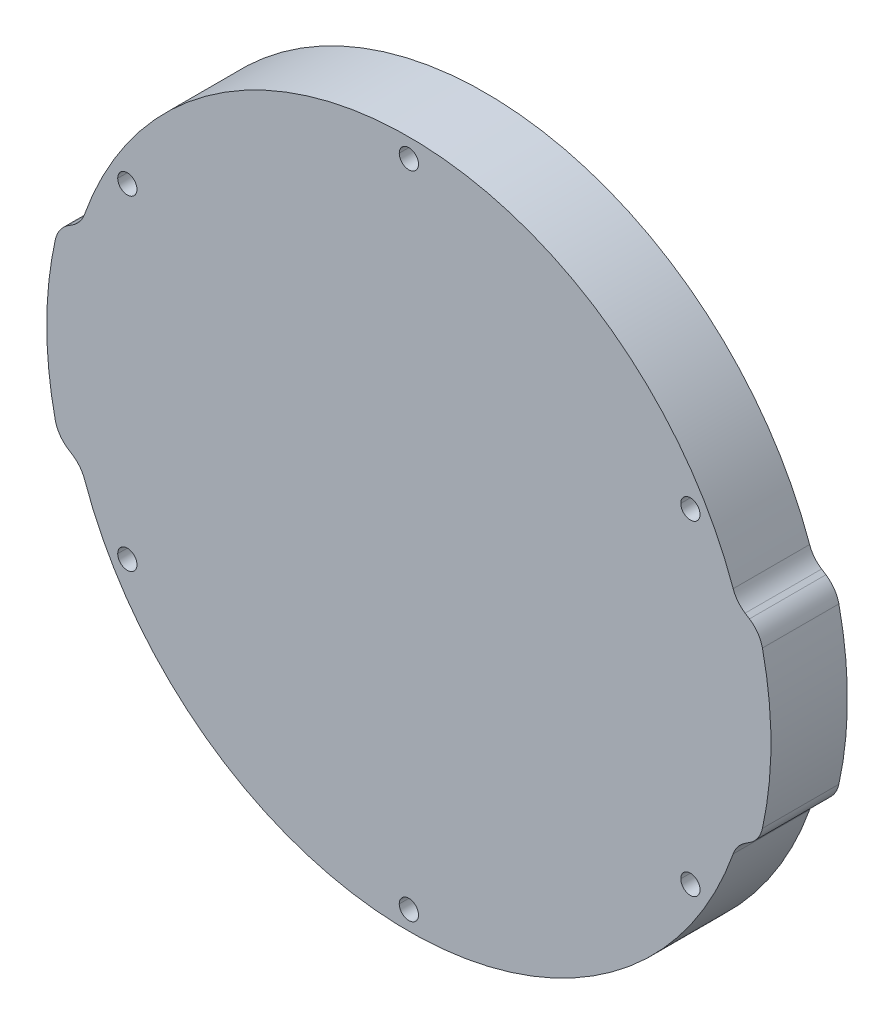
ISO-10303-21;
HEADER;
FILE_DESCRIPTION(('STEP AP214'),'2;1');
FILE_NAME('part.step','',(''),(''),'','','');
FILE_SCHEMA(('AUTOMOTIVE_DESIGN { 1 0 10303 214 1 1 1 1 }'));
ENDSEC;
DATA;
#1=APPLICATION_CONTEXT('core data for automotive mechanical design processes');
#2=APPLICATION_PROTOCOL_DEFINITION('international standard','automotive_design',2000,#1);
#3=PRODUCT_CONTEXT('',#1,'mechanical');
#4=PRODUCT('Part','Part','',(#3));
#5=PRODUCT_RELATED_PRODUCT_CATEGORY('part','',(#4));
#6=PRODUCT_DEFINITION_FORMATION('','',#4);
#7=PRODUCT_DEFINITION_CONTEXT('part definition',#1,'design');
#8=PRODUCT_DEFINITION('design','',#6,#7);
#9=PRODUCT_DEFINITION_SHAPE('','',#8);
#10=(LENGTH_UNIT() NAMED_UNIT(*) SI_UNIT(.MILLI.,.METRE.));
#11=(NAMED_UNIT(*) PLANE_ANGLE_UNIT() SI_UNIT($,.RADIAN.));
#12=(NAMED_UNIT(*) SI_UNIT($,.STERADIAN.) SOLID_ANGLE_UNIT());
#13=UNCERTAINTY_MEASURE_WITH_UNIT(LENGTH_MEASURE(1.E-05),#10,'distance_accuracy_value','');
#14=(GEOMETRIC_REPRESENTATION_CONTEXT(3) GLOBAL_UNCERTAINTY_ASSIGNED_CONTEXT((#13)) GLOBAL_UNIT_ASSIGNED_CONTEXT((#10,
#11,#12)) REPRESENTATION_CONTEXT('',''));
#15=CARTESIAN_POINT('',(0.,0.,0.));
#16=DIRECTION('',(0.,0.,1.));
#17=DIRECTION('',(1.,0.,0.));
#18=AXIS2_PLACEMENT_3D('',#15,#16,#17);
#19=CARTESIAN_POINT('',(-58.5852887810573,20.7457571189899,12.7));
#20=DIRECTION('',(0.,0.,-1.));
#21=DIRECTION('',(-1.,0.,0.));
#22=AXIS2_PLACEMENT_3D('',#19,#20,#21);
#23=CYLINDRICAL_SURFACE('',#22,5.);
#24=CARTESIAN_POINT('',(-58.5852887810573,20.7457571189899,12.7));
#25=DIRECTION('',(0.,0.,-1.));
#26=DIRECTION('',(1.,0.,0.));
#27=AXIS2_PLACEMENT_3D('',#24,#25,#26);
#28=CIRCLE('',#27,5.);
#29=CARTESIAN_POINT('',(-53.87207166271,19.0767501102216,12.7));
#30=VERTEX_POINT('',#29);
#31=CARTESIAN_POINT('',(-55.8597455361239,16.5539300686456,12.7));
#32=VERTEX_POINT('',#31);
#33=EDGE_CURVE('E462',#30,#32,#28,.T.);
#34=ORIENTED_EDGE('',*,*,#33,.F.);
#35=DIRECTION('',(0.,0.,1.));
#36=VECTOR('',#35,1.);
#37=CARTESIAN_POINT('',(-53.87207166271,19.0767501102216,12.7));
#38=LINE('',#37,#36);
#39=CARTESIAN_POINT('',(-53.87207166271,19.0767501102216,0.));
#40=VERTEX_POINT('',#39);
#41=EDGE_CURVE('E569',#40,#30,#38,.T.);
#42=ORIENTED_EDGE('',*,*,#41,.F.);
#43=CARTESIAN_POINT('',(-58.5852887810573,20.7457571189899,0.));
#44=DIRECTION('',(0.,0.,1.));
#45=DIRECTION('',(1.,0.,0.));
#46=AXIS2_PLACEMENT_3D('',#43,#44,#45);
#47=CIRCLE('',#46,5.);
#48=CARTESIAN_POINT('',(-55.8597455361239,16.5539300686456,0.));
#49=VERTEX_POINT('',#48);
#50=EDGE_CURVE('E542',#49,#40,#47,.T.);
#51=ORIENTED_EDGE('',*,*,#50,.F.);
#52=DIRECTION('',(0.,0.,-1.));
#53=VECTOR('',#52,1.);
#54=CARTESIAN_POINT('',(-55.8597455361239,16.5539300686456,0.));
#55=LINE('',#54,#53);
#56=EDGE_CURVE('E575',#32,#49,#55,.T.);
#57=ORIENTED_EDGE('',*,*,#56,.F.);
#58=EDGE_LOOP('',(#34,#42,#51,#57));
#59=FACE_BOUND('',#58,.T.);
#60=ADVANCED_FACE('F17',(#59),#23,.F.);
#61=CARTESIAN_POINT('',(-53.8518302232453,11.8954983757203,12.7));
#62=DIRECTION('',(0.,0.,-1.));
#63=DIRECTION('',(-1.,0.,0.));
#64=AXIS2_PLACEMENT_3D('',#61,#62,#63);
#65=CYLINDRICAL_SURFACE('',#64,5.);
#66=CARTESIAN_POINT('',(-53.8518302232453,11.8954983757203,12.7));
#67=DIRECTION('',(0.,0.,1.));
#68=DIRECTION('',(1.,0.,0.));
#69=AXIS2_PLACEMENT_3D('',#66,#67,#68);
#70=CIRCLE('',#69,5.);
#71=CARTESIAN_POINT('',(-56.5773734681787,16.0873254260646,12.7));
#72=VERTEX_POINT('',#71);
#73=CARTESIAN_POINT('',(-58.7341357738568,12.97396604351,12.7));
#74=VERTEX_POINT('',#73);
#75=EDGE_CURVE('E470',#72,#74,#70,.T.);
#76=ORIENTED_EDGE('',*,*,#75,.F.);
#77=DIRECTION('',(0.,0.,1.));
#78=VECTOR('',#77,1.);
#79=CARTESIAN_POINT('',(-56.5773734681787,16.0873254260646,12.7));
#80=LINE('',#79,#78);
#81=CARTESIAN_POINT('',(-56.5773734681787,16.0873254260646,0.));
#82=VERTEX_POINT('',#81);
#83=EDGE_CURVE('E572',#82,#72,#80,.T.);
#84=ORIENTED_EDGE('',*,*,#83,.F.);
#85=CARTESIAN_POINT('',(-53.8518302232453,11.8954983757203,0.));
#86=DIRECTION('',(0.,0.,-1.));
#87=DIRECTION('',(1.,0.,0.));
#88=AXIS2_PLACEMENT_3D('',#85,#86,#87);
#89=CIRCLE('',#88,5.);
#90=CARTESIAN_POINT('',(-58.7341357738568,12.97396604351,0.));
#91=VERTEX_POINT('',#90);
#92=EDGE_CURVE('E336',#91,#82,#89,.T.);
#93=ORIENTED_EDGE('',*,*,#92,.F.);
#94=DIRECTION('',(0.,0.,-1.));
#95=VECTOR('',#94,1.);
#96=CARTESIAN_POINT('',(-58.7341357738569,12.97396604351,12.7));
#97=LINE('',#96,#95);
#98=EDGE_CURVE('E576',#74,#91,#97,.T.);
#99=ORIENTED_EDGE('',*,*,#98,.F.);
#100=EDGE_LOOP('',(#76,#84,#93,#99));
#101=FACE_BOUND('',#100,.T.);
#102=ADVANCED_FACE('F639',(#101),#65,.T.);
#103=CARTESIAN_POINT('',(-53.8518302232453,-11.8954983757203,12.7));
#104=DIRECTION('',(0.,0.,-1.));
#105=DIRECTION('',(-1.,0.,0.));
#106=AXIS2_PLACEMENT_3D('',#103,#104,#105);
#107=CYLINDRICAL_SURFACE('',#106,5.);
#108=CARTESIAN_POINT('',(-53.8518302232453,-11.8954983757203,12.7));
#109=DIRECTION('',(0.,0.,1.));
#110=DIRECTION('',(1.,0.,0.));
#111=AXIS2_PLACEMENT_3D('',#108,#109,#110);
#112=CIRCLE('',#111,5.);
#113=CARTESIAN_POINT('',(-58.7341357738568,-12.97396604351,12.7));
#114=VERTEX_POINT('',#113);
#115=CARTESIAN_POINT('',(-56.5773734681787,-16.0873254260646,12.7));
#116=VERTEX_POINT('',#115);
#117=EDGE_CURVE('E485',#114,#116,#112,.T.);
#118=ORIENTED_EDGE('',*,*,#117,.F.);
#119=DIRECTION('',(0.,0.,1.));
#120=VECTOR('',#119,1.);
#121=CARTESIAN_POINT('',(-58.7341357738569,-12.97396604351,12.7));
#122=LINE('',#121,#120);
#123=CARTESIAN_POINT('',(-58.7341357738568,-12.97396604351,0.));
#124=VERTEX_POINT('',#123);
#125=EDGE_CURVE('E324',#124,#114,#122,.T.);
#126=ORIENTED_EDGE('',*,*,#125,.F.);
#127=CARTESIAN_POINT('',(-53.8518302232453,-11.8954983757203,0.));
#128=DIRECTION('',(0.,0.,-1.));
#129=DIRECTION('',(1.,0.,0.));
#130=AXIS2_PLACEMENT_3D('',#127,#128,#129);
#131=CIRCLE('',#130,5.);
#132=CARTESIAN_POINT('',(-56.5773734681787,-16.0873254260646,0.));
#133=VERTEX_POINT('',#132);
#134=EDGE_CURVE('E337',#133,#124,#131,.T.);
#135=ORIENTED_EDGE('',*,*,#134,.F.);
#136=DIRECTION('',(0.,0.,-1.));
#137=VECTOR('',#136,1.);
#138=CARTESIAN_POINT('',(-56.5773734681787,-16.0873254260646,12.7));
#139=LINE('',#138,#137);
#140=EDGE_CURVE('E474',#116,#133,#139,.T.);
#141=ORIENTED_EDGE('',*,*,#140,.F.);
#142=EDGE_LOOP('',(#118,#126,#135,#141));
#143=FACE_BOUND('',#142,.T.);
#144=ADVANCED_FACE('F626',(#143),#107,.T.);
#145=CARTESIAN_POINT('',(-58.5852887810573,-20.7457571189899,12.7));
#146=DIRECTION('',(0.,0.,-1.));
#147=DIRECTION('',(-1.,0.,0.));
#148=AXIS2_PLACEMENT_3D('',#145,#146,#147);
#149=CYLINDRICAL_SURFACE('',#148,5.);
#150=CARTESIAN_POINT('',(-58.5852887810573,-20.7457571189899,12.7));
#151=DIRECTION('',(0.,0.,-1.));
#152=DIRECTION('',(1.,0.,0.));
#153=AXIS2_PLACEMENT_3D('',#150,#151,#152);
#154=CIRCLE('',#153,5.);
#155=CARTESIAN_POINT('',(-55.8597455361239,-16.5539300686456,12.7));
#156=VERTEX_POINT('',#155);
#157=CARTESIAN_POINT('',(-53.87207166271,-19.0767501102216,12.7));
#158=VERTEX_POINT('',#157);
#159=EDGE_CURVE('E492',#156,#158,#154,.T.);
#160=ORIENTED_EDGE('',*,*,#159,.F.);
#161=DIRECTION('',(0.,0.,1.));
#162=VECTOR('',#161,1.);
#163=CARTESIAN_POINT('',(-55.8597455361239,-16.5539300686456,12.7));
#164=LINE('',#163,#162);
#165=CARTESIAN_POINT('',(-55.8597455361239,-16.5539300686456,0.));
#166=VERTEX_POINT('',#165);
#167=EDGE_CURVE('E579',#166,#156,#164,.T.);
#168=ORIENTED_EDGE('',*,*,#167,.F.);
#169=CARTESIAN_POINT('',(-58.5852887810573,-20.7457571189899,0.));
#170=DIRECTION('',(0.,0.,1.));
#171=DIRECTION('',(1.,0.,0.));
#172=AXIS2_PLACEMENT_3D('',#169,#170,#171);
#173=CIRCLE('',#172,5.);
#174=CARTESIAN_POINT('',(-53.87207166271,-19.0767501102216,0.));
#175=VERTEX_POINT('',#174);
#176=EDGE_CURVE('E528',#175,#166,#173,.T.);
#177=ORIENTED_EDGE('',*,*,#176,.F.);
#178=DIRECTION('',(0.,0.,-1.));
#179=VECTOR('',#178,1.);
#180=CARTESIAN_POINT('',(-53.87207166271,-19.0767501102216,12.7));
#181=LINE('',#180,#179);
#182=EDGE_CURVE('E419',#158,#175,#181,.T.);
#183=ORIENTED_EDGE('',*,*,#182,.F.);
#184=EDGE_LOOP('',(#160,#168,#177,#183));
#185=FACE_BOUND('',#184,.T.);
#186=ADVANCED_FACE('F617',(#185),#149,.F.);
#187=CARTESIAN_POINT('',(58.5852887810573,20.7457571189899,12.7));
#188=DIRECTION('',(0.,0.,-1.));
#189=DIRECTION('',(-1.,0.,0.));
#190=AXIS2_PLACEMENT_3D('',#187,#188,#189);
#191=CYLINDRICAL_SURFACE('',#190,5.);
#192=CARTESIAN_POINT('',(58.5852887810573,20.7457571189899,12.7));
#193=DIRECTION('',(0.,0.,-1.));
#194=DIRECTION('',(1.,0.,0.));
#195=AXIS2_PLACEMENT_3D('',#192,#193,#194);
#196=CIRCLE('',#195,5.);
#197=CARTESIAN_POINT('',(55.8597455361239,16.5539300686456,12.7));
#198=VERTEX_POINT('',#197);
#199=CARTESIAN_POINT('',(53.87207166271,19.0767501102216,12.7));
#200=VERTEX_POINT('',#199);
#201=EDGE_CURVE('E388',#198,#200,#196,.T.);
#202=ORIENTED_EDGE('',*,*,#201,.F.);
#203=DIRECTION('',(0.,0.,1.));
#204=VECTOR('',#203,1.);
#205=CARTESIAN_POINT('',(55.8597455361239,16.5539300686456,12.7));
#206=LINE('',#205,#204);
#207=CARTESIAN_POINT('',(55.8597455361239,16.5539300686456,0.));
#208=VERTEX_POINT('',#207);
#209=EDGE_CURVE('E11',#208,#198,#206,.T.);
#210=ORIENTED_EDGE('',*,*,#209,.F.);
#211=CARTESIAN_POINT('',(58.5852887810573,20.7457571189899,0.));
#212=DIRECTION('',(0.,0.,1.));
#213=DIRECTION('',(1.,0.,0.));
#214=AXIS2_PLACEMENT_3D('',#211,#212,#213);
#215=CIRCLE('',#214,5.);
#216=CARTESIAN_POINT('',(53.87207166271,19.0767501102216,0.));
#217=VERTEX_POINT('',#216);
#218=EDGE_CURVE('E547',#217,#208,#215,.T.);
#219=ORIENTED_EDGE('',*,*,#218,.F.);
#220=DIRECTION('',(0.,0.,-1.));
#221=VECTOR('',#220,1.);
#222=CARTESIAN_POINT('',(53.87207166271,19.0767501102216,12.7));
#223=LINE('',#222,#221);
#224=EDGE_CURVE('E566',#200,#217,#223,.T.);
#225=ORIENTED_EDGE('',*,*,#224,.F.);
#226=EDGE_LOOP('',(#202,#210,#219,#225));
#227=FACE_BOUND('',#226,.T.);
#228=ADVANCED_FACE('F650',(#227),#191,.F.);
#229=CARTESIAN_POINT('',(53.8518302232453,11.8954983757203,12.7));
#230=DIRECTION('',(0.,0.,-1.));
#231=DIRECTION('',(-1.,0.,0.));
#232=AXIS2_PLACEMENT_3D('',#229,#230,#231);
#233=CYLINDRICAL_SURFACE('',#232,5.);
#234=CARTESIAN_POINT('',(53.8518302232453,11.8954983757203,12.7));
#235=DIRECTION('',(0.,0.,1.));
#236=DIRECTION('',(1.,0.,0.));
#237=AXIS2_PLACEMENT_3D('',#234,#235,#236);
#238=CIRCLE('',#237,5.);
#239=CARTESIAN_POINT('',(58.7341357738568,12.97396604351,12.7));
#240=VERTEX_POINT('',#239);
#241=CARTESIAN_POINT('',(56.5773734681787,16.0873254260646,12.7));
#242=VERTEX_POINT('',#241);
#243=EDGE_CURVE('E452',#240,#242,#238,.T.);
#244=ORIENTED_EDGE('',*,*,#243,.F.);
#245=DIRECTION('',(0.,0.,1.));
#246=VECTOR('',#245,1.);
#247=CARTESIAN_POINT('',(58.7341357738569,12.97396604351,12.7));
#248=LINE('',#247,#246);
#249=CARTESIAN_POINT('',(58.7341357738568,12.97396604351,0.));
#250=VERTEX_POINT('',#249);
#251=EDGE_CURVE('E313',#250,#240,#248,.T.);
#252=ORIENTED_EDGE('',*,*,#251,.F.);
#253=CARTESIAN_POINT('',(53.8518302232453,11.8954983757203,0.));
#254=DIRECTION('',(0.,0.,-1.));
#255=DIRECTION('',(1.,0.,0.));
#256=AXIS2_PLACEMENT_3D('',#253,#254,#255);
#257=CIRCLE('',#256,5.);
#258=CARTESIAN_POINT('',(56.5773734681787,16.0873254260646,0.));
#259=VERTEX_POINT('',#258);
#260=EDGE_CURVE('E406',#259,#250,#257,.T.);
#261=ORIENTED_EDGE('',*,*,#260,.F.);
#262=DIRECTION('',(0.,0.,-1.));
#263=VECTOR('',#262,1.);
#264=CARTESIAN_POINT('',(56.5773734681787,16.0873254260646,12.7));
#265=LINE('',#264,#263);
#266=EDGE_CURVE('E20',#242,#259,#265,.T.);
#267=ORIENTED_EDGE('',*,*,#266,.F.);
#268=EDGE_LOOP('',(#244,#252,#261,#267));
#269=FACE_BOUND('',#268,.T.);
#270=ADVANCED_FACE('F601',(#269),#233,.T.);
#271=CARTESIAN_POINT('',(58.5852887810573,-20.7457571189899,12.7));
#272=DIRECTION('',(0.,0.,-1.));
#273=DIRECTION('',(-1.,0.,0.));
#274=AXIS2_PLACEMENT_3D('',#271,#272,#273);
#275=CYLINDRICAL_SURFACE('',#274,5.);
#276=CARTESIAN_POINT('',(58.5852887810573,-20.7457571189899,12.7));
#277=DIRECTION('',(0.,0.,-1.));
#278=DIRECTION('',(1.,0.,0.));
#279=AXIS2_PLACEMENT_3D('',#276,#277,#278);
#280=CIRCLE('',#279,5.);
#281=CARTESIAN_POINT('',(53.87207166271,-19.0767501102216,12.7));
#282=VERTEX_POINT('',#281);
#283=CARTESIAN_POINT('',(55.8597455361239,-16.5539300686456,12.7));
#284=VERTEX_POINT('',#283);
#285=EDGE_CURVE('E307',#282,#284,#280,.T.);
#286=ORIENTED_EDGE('',*,*,#285,.F.);
#287=DIRECTION('',(0.,0.,1.));
#288=VECTOR('',#287,1.);
#289=CARTESIAN_POINT('',(53.87207166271,-19.0767501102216,12.7));
#290=LINE('',#289,#288);
#291=CARTESIAN_POINT('',(53.87207166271,-19.0767501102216,0.));
#292=VERTEX_POINT('',#291);
#293=EDGE_CURVE('E471',#292,#282,#290,.T.);
#294=ORIENTED_EDGE('',*,*,#293,.F.);
#295=CARTESIAN_POINT('',(58.5852887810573,-20.7457571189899,0.));
#296=DIRECTION('',(0.,0.,1.));
#297=DIRECTION('',(1.,0.,0.));
#298=AXIS2_PLACEMENT_3D('',#295,#296,#297);
#299=CIRCLE('',#298,5.);
#300=CARTESIAN_POINT('',(55.8597455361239,-16.5539300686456,0.));
#301=VERTEX_POINT('',#300);
#302=EDGE_CURVE('E517',#301,#292,#299,.T.);
#303=ORIENTED_EDGE('',*,*,#302,.F.);
#304=DIRECTION('',(0.,0.,-1.));
#305=VECTOR('',#304,1.);
#306=CARTESIAN_POINT('',(55.8597455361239,-16.5539300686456,0.));
#307=LINE('',#306,#305);
#308=EDGE_CURVE('E317',#284,#301,#307,.T.);
#309=ORIENTED_EDGE('',*,*,#308,.F.);
#310=EDGE_LOOP('',(#286,#294,#303,#309));
#311=FACE_BOUND('',#310,.T.);
#312=ADVANCED_FACE('F610',(#311),#275,.F.);
#313=CARTESIAN_POINT('',(53.8518302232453,-11.8954983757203,12.7));
#314=DIRECTION('',(0.,0.,-1.));
#315=DIRECTION('',(-1.,0.,0.));
#316=AXIS2_PLACEMENT_3D('',#313,#314,#315);
#317=CYLINDRICAL_SURFACE('',#316,5.);
#318=CARTESIAN_POINT('',(53.8518302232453,-11.8954983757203,12.7));
#319=DIRECTION('',(0.,0.,1.));
#320=DIRECTION('',(1.,0.,0.));
#321=AXIS2_PLACEMENT_3D('',#318,#319,#320);
#322=CIRCLE('',#321,5.);
#323=CARTESIAN_POINT('',(56.5773734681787,-16.0873254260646,12.7));
#324=VERTEX_POINT('',#323);
#325=CARTESIAN_POINT('',(58.7341357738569,-12.9739660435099,12.7));
#326=VERTEX_POINT('',#325);
#327=EDGE_CURVE('E444',#324,#326,#322,.T.);
#328=ORIENTED_EDGE('',*,*,#327,.F.);
#329=DIRECTION('',(0.,0.,1.));
#330=VECTOR('',#329,1.);
#331=CARTESIAN_POINT('',(56.5773734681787,-16.0873254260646,12.7));
#332=LINE('',#331,#330);
#333=CARTESIAN_POINT('',(56.5773734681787,-16.0873254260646,0.));
#334=VERTEX_POINT('',#333);
#335=EDGE_CURVE('E320',#334,#324,#332,.T.);
#336=ORIENTED_EDGE('',*,*,#335,.F.);
#337=CARTESIAN_POINT('',(53.8518302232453,-11.8954983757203,0.));
#338=DIRECTION('',(0.,0.,-1.));
#339=DIRECTION('',(1.,0.,0.));
#340=AXIS2_PLACEMENT_3D('',#337,#338,#339);
#341=CIRCLE('',#340,5.);
#342=CARTESIAN_POINT('',(58.7341357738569,-12.9739660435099,0.));
#343=VERTEX_POINT('',#342);
#344=EDGE_CURVE('E509',#343,#334,#341,.T.);
#345=ORIENTED_EDGE('',*,*,#344,.F.);
#346=DIRECTION('',(0.,0.,-1.));
#347=VECTOR('',#346,1.);
#348=CARTESIAN_POINT('',(58.7341357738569,-12.97396604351,12.7));
#349=LINE('',#348,#347);
#350=EDGE_CURVE('E316',#326,#343,#349,.T.);
#351=ORIENTED_EDGE('',*,*,#350,.F.);
#352=EDGE_LOOP('',(#328,#336,#345,#351));
#353=FACE_BOUND('',#352,.T.);
#354=ADVANCED_FACE('F594',(#353),#317,.T.);
#355=CARTESIAN_POINT('',(-46.7653718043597,27.,12.7));
#356=DIRECTION('',(0.,0.,-1.));
#357=DIRECTION('',(-1.,0.,0.));
#358=AXIS2_PLACEMENT_3D('',#355,#356,#357);
#359=CYLINDRICAL_SURFACE('',#358,1.6);
#360=DIRECTION('',(0.,0.,-1.));
#361=VECTOR('',#360,1.);
#362=CARTESIAN_POINT('',(-45.1653718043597,27.,12.7));
#363=LINE('',#362,#361);
#364=CARTESIAN_POINT('',(-45.1653718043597,27.,12.7));
#365=VERTEX_POINT('',#364);
#366=CARTESIAN_POINT('',(-45.1653718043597,27.,0.));
#367=VERTEX_POINT('',#366);
#368=EDGE_CURVE('E280',#365,#367,#363,.T.);
#369=ORIENTED_EDGE('',*,*,#368,.F.);
#370=CARTESIAN_POINT('',(-46.7653718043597,27.,12.7));
#371=DIRECTION('',(0.,0.,1.));
#372=DIRECTION('',(1.,0.,0.));
#373=AXIS2_PLACEMENT_3D('',#370,#371,#372);
#374=CIRCLE('',#373,1.6);
#375=CARTESIAN_POINT('',(-48.3653718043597,27.,12.7));
#376=VERTEX_POINT('',#375);
#377=EDGE_CURVE('E274',#365,#376,#374,.T.);
#378=ORIENTED_EDGE('',*,*,#377,.T.);
#379=DIRECTION('',(0.,0.,-1.));
#380=VECTOR('',#379,1.);
#381=CARTESIAN_POINT('',(-48.3653718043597,27.,12.7));
#382=LINE('',#381,#380);
#383=CARTESIAN_POINT('',(-48.3653718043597,27.,0.));
#384=VERTEX_POINT('',#383);
#385=EDGE_CURVE('E277',#376,#384,#382,.T.);
#386=ORIENTED_EDGE('',*,*,#385,.T.);
#387=CARTESIAN_POINT('',(-46.7653718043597,27.,0.));
#388=DIRECTION('',(0.,0.,1.));
#389=DIRECTION('',(1.,0.,0.));
#390=AXIS2_PLACEMENT_3D('',#387,#388,#389);
#391=CIRCLE('',#390,1.6);
#392=EDGE_CURVE('E344',#367,#384,#391,.T.);
#393=ORIENTED_EDGE('',*,*,#392,.F.);
#394=EDGE_LOOP('',(#369,#378,#386,#393));
#395=FACE_BOUND('',#394,.T.);
#396=ADVANCED_FACE('F276',(#395),#359,.F.);
#397=CARTESIAN_POINT('',(0.,-54.,12.7));
#398=DIRECTION('',(0.,0.,-1.));
#399=DIRECTION('',(-1.,0.,0.));
#400=AXIS2_PLACEMENT_3D('',#397,#398,#399);
#401=CYLINDRICAL_SURFACE('',#400,1.6);
#402=DIRECTION('',(0.,0.,-1.));
#403=VECTOR('',#402,1.);
#404=CARTESIAN_POINT('',(1.6,-54.,12.7));
#405=LINE('',#404,#403);
#406=CARTESIAN_POINT('',(1.6,-54.,12.7));
#407=VERTEX_POINT('',#406);
#408=CARTESIAN_POINT('',(1.6,-54.,0.));
#409=VERTEX_POINT('',#408);
#410=EDGE_CURVE('E332',#407,#409,#405,.T.);
#411=ORIENTED_EDGE('',*,*,#410,.F.);
#412=CARTESIAN_POINT('',(0.,-54.,12.7));
#413=DIRECTION('',(0.,0.,1.));
#414=DIRECTION('',(1.,0.,0.));
#415=AXIS2_PLACEMENT_3D('',#412,#413,#414);
#416=CIRCLE('',#415,1.6);
#417=CARTESIAN_POINT('',(-1.6,-54.,12.7));
#418=VERTEX_POINT('',#417);
#419=EDGE_CURVE('E310',#407,#418,#416,.T.);
#420=ORIENTED_EDGE('',*,*,#419,.T.);
#421=DIRECTION('',(0.,0.,-1.));
#422=VECTOR('',#421,1.);
#423=CARTESIAN_POINT('',(-1.6,-54.,12.7));
#424=LINE('',#423,#422);
#425=CARTESIAN_POINT('',(-1.6,-54.,0.));
#426=VERTEX_POINT('',#425);
#427=EDGE_CURVE('E331',#418,#426,#424,.T.);
#428=ORIENTED_EDGE('',*,*,#427,.T.);
#429=CARTESIAN_POINT('',(0.,-54.,0.));
#430=DIRECTION('',(0.,0.,1.));
#431=DIRECTION('',(1.,0.,0.));
#432=AXIS2_PLACEMENT_3D('',#429,#430,#431);
#433=CIRCLE('',#432,1.6);
#434=EDGE_CURVE('E341',#409,#426,#433,.T.);
#435=ORIENTED_EDGE('',*,*,#434,.F.);
#436=EDGE_LOOP('',(#411,#420,#428,#435));
#437=FACE_BOUND('',#436,.T.);
#438=ADVANCED_FACE('F721',(#437),#401,.F.);
#439=CARTESIAN_POINT('',(46.7653718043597,-27.,12.7));
#440=DIRECTION('',(0.,0.,-1.));
#441=DIRECTION('',(-1.,0.,0.));
#442=AXIS2_PLACEMENT_3D('',#439,#440,#441);
#443=CYLINDRICAL_SURFACE('',#442,1.6);
#444=DIRECTION('',(0.,0.,-1.));
#445=VECTOR('',#444,1.);
#446=CARTESIAN_POINT('',(48.3653718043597,-27.,12.7));
#447=LINE('',#446,#445);
#448=CARTESIAN_POINT('',(48.3653718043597,-27.,12.7));
#449=VERTEX_POINT('',#448);
#450=CARTESIAN_POINT('',(48.3653718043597,-27.,0.));
#451=VERTEX_POINT('',#450);
#452=EDGE_CURVE('E365',#449,#451,#447,.T.);
#453=ORIENTED_EDGE('',*,*,#452,.F.);
#454=CARTESIAN_POINT('',(46.7653718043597,-27.,12.7));
#455=DIRECTION('',(0.,0.,1.));
#456=DIRECTION('',(1.,0.,0.));
#457=AXIS2_PLACEMENT_3D('',#454,#455,#456);
#458=CIRCLE('',#457,1.6);
#459=CARTESIAN_POINT('',(45.1653718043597,-27.,12.7));
#460=VERTEX_POINT('',#459);
#461=EDGE_CURVE('E286',#449,#460,#458,.T.);
#462=ORIENTED_EDGE('',*,*,#461,.T.);
#463=DIRECTION('',(0.,0.,-1.));
#464=VECTOR('',#463,1.);
#465=CARTESIAN_POINT('',(45.1653718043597,-27.,12.7));
#466=LINE('',#465,#464);
#467=CARTESIAN_POINT('',(45.1653718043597,-27.,0.));
#468=VERTEX_POINT('',#467);
#469=EDGE_CURVE('E356',#460,#468,#466,.T.);
#470=ORIENTED_EDGE('',*,*,#469,.T.);
#471=CARTESIAN_POINT('',(46.7653718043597,-27.,0.));
#472=DIRECTION('',(0.,0.,1.));
#473=DIRECTION('',(1.,0.,0.));
#474=AXIS2_PLACEMENT_3D('',#471,#472,#473);
#475=CIRCLE('',#474,1.6);
#476=EDGE_CURVE('E345',#451,#468,#475,.T.);
#477=ORIENTED_EDGE('',*,*,#476,.F.);
#478=EDGE_LOOP('',(#453,#462,#470,#477));
#479=FACE_BOUND('',#478,.T.);
#480=ADVANCED_FACE('F731',(#479),#443,.F.);
#481=CARTESIAN_POINT('',(46.7653718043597,27.,12.7));
#482=DIRECTION('',(0.,0.,-1.));
#483=DIRECTION('',(-1.,0.,0.));
#484=AXIS2_PLACEMENT_3D('',#481,#482,#483);
#485=CYLINDRICAL_SURFACE('',#484,1.6);
#486=DIRECTION('',(0.,0.,-1.));
#487=VECTOR('',#486,1.);
#488=CARTESIAN_POINT('',(48.3653718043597,27.,12.7));
#489=LINE('',#488,#487);
#490=CARTESIAN_POINT('',(48.3653718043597,27.,12.7));
#491=VERTEX_POINT('',#490);
#492=CARTESIAN_POINT('',(48.3653718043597,27.,0.));
#493=VERTEX_POINT('',#492);
#494=EDGE_CURVE('E372',#491,#493,#489,.T.);
#495=ORIENTED_EDGE('',*,*,#494,.F.);
#496=CARTESIAN_POINT('',(46.7653718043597,27.,12.7));
#497=DIRECTION('',(0.,0.,1.));
#498=DIRECTION('',(1.,0.,0.));
#499=AXIS2_PLACEMENT_3D('',#496,#497,#498);
#500=CIRCLE('',#499,1.6);
#501=CARTESIAN_POINT('',(45.1653718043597,27.,12.7));
#502=VERTEX_POINT('',#501);
#503=EDGE_CURVE('E479',#491,#502,#500,.T.);
#504=ORIENTED_EDGE('',*,*,#503,.T.);
#505=DIRECTION('',(0.,0.,-1.));
#506=VECTOR('',#505,1.);
#507=CARTESIAN_POINT('',(45.1653718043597,27.,12.7));
#508=LINE('',#507,#506);
#509=CARTESIAN_POINT('',(45.1653718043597,27.,0.));
#510=VERTEX_POINT('',#509);
#511=EDGE_CURVE('E383',#502,#510,#508,.T.);
#512=ORIENTED_EDGE('',*,*,#511,.T.);
#513=CARTESIAN_POINT('',(46.7653718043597,27.,0.));
#514=DIRECTION('',(0.,0.,1.));
#515=DIRECTION('',(1.,0.,0.));
#516=AXIS2_PLACEMENT_3D('',#513,#514,#515);
#517=CIRCLE('',#516,1.6);
#518=EDGE_CURVE('E520',#493,#510,#517,.T.);
#519=ORIENTED_EDGE('',*,*,#518,.F.);
#520=EDGE_LOOP('',(#495,#504,#512,#519));
#521=FACE_BOUND('',#520,.T.);
#522=ADVANCED_FACE('F742',(#521),#485,.F.);
#523=CARTESIAN_POINT('',(-46.7653718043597,-27.,12.7));
#524=DIRECTION('',(0.,0.,-1.));
#525=DIRECTION('',(-1.,0.,0.));
#526=AXIS2_PLACEMENT_3D('',#523,#524,#525);
#527=CYLINDRICAL_SURFACE('',#526,1.6);
#528=DIRECTION('',(0.,0.,-1.));
#529=VECTOR('',#528,1.);
#530=CARTESIAN_POINT('',(-45.1653718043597,-27.,12.7));
#531=LINE('',#530,#529);
#532=CARTESIAN_POINT('',(-45.1653718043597,-27.,12.7));
#533=VERTEX_POINT('',#532);
#534=CARTESIAN_POINT('',(-45.1653718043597,-27.,0.));
#535=VERTEX_POINT('',#534);
#536=EDGE_CURVE('E397',#533,#535,#531,.T.);
#537=ORIENTED_EDGE('',*,*,#536,.F.);
#538=CARTESIAN_POINT('',(-46.7653718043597,-27.,12.7));
#539=DIRECTION('',(0.,0.,1.));
#540=DIRECTION('',(1.,0.,0.));
#541=AXIS2_PLACEMENT_3D('',#538,#539,#540);
#542=CIRCLE('',#541,1.6);
#543=CARTESIAN_POINT('',(-48.3653718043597,-27.,12.7));
#544=VERTEX_POINT('',#543);
#545=EDGE_CURVE('E440',#533,#544,#542,.T.);
#546=ORIENTED_EDGE('',*,*,#545,.T.);
#547=DIRECTION('',(0.,0.,-1.));
#548=VECTOR('',#547,1.);
#549=CARTESIAN_POINT('',(-48.3653718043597,-27.,12.7));
#550=LINE('',#549,#548);
#551=CARTESIAN_POINT('',(-48.3653718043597,-27.,0.));
#552=VERTEX_POINT('',#551);
#553=EDGE_CURVE('E355',#544,#552,#550,.T.);
#554=ORIENTED_EDGE('',*,*,#553,.T.);
#555=CARTESIAN_POINT('',(-46.7653718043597,-27.,0.));
#556=DIRECTION('',(0.,0.,1.));
#557=DIRECTION('',(1.,0.,0.));
#558=AXIS2_PLACEMENT_3D('',#555,#556,#557);
#559=CIRCLE('',#558,1.6);
#560=EDGE_CURVE('E405',#535,#552,#559,.T.);
#561=ORIENTED_EDGE('',*,*,#560,.F.);
#562=EDGE_LOOP('',(#537,#546,#554,#561));
#563=FACE_BOUND('',#562,.T.);
#564=ADVANCED_FACE('F753',(#563),#527,.F.);
#565=CARTESIAN_POINT('',(0.,54.,12.7));
#566=DIRECTION('',(0.,0.,-1.));
#567=DIRECTION('',(-1.,0.,0.));
#568=AXIS2_PLACEMENT_3D('',#565,#566,#567);
#569=CYLINDRICAL_SURFACE('',#568,1.6);
#570=DIRECTION('',(0.,0.,-1.));
#571=VECTOR('',#570,1.);
#572=CARTESIAN_POINT('',(1.6,54.,12.7));
#573=LINE('',#572,#571);
#574=CARTESIAN_POINT('',(1.6,54.,12.7));
#575=VERTEX_POINT('',#574);
#576=CARTESIAN_POINT('',(1.6,54.,0.));
#577=VERTEX_POINT('',#576);
#578=EDGE_CURVE('E354',#575,#577,#573,.T.);
#579=ORIENTED_EDGE('',*,*,#578,.F.);
#580=CARTESIAN_POINT('',(0.,54.,12.7));
#581=DIRECTION('',(0.,0.,1.));
#582=DIRECTION('',(1.,0.,0.));
#583=AXIS2_PLACEMENT_3D('',#580,#581,#582);
#584=CIRCLE('',#583,1.6);
#585=CARTESIAN_POINT('',(-1.6,54.,12.7));
#586=VERTEX_POINT('',#585);
#587=EDGE_CURVE('E482',#575,#586,#584,.T.);
#588=ORIENTED_EDGE('',*,*,#587,.T.);
#589=DIRECTION('',(0.,0.,-1.));
#590=VECTOR('',#589,1.);
#591=CARTESIAN_POINT('',(-1.6,54.,12.7));
#592=LINE('',#591,#590);
#593=CARTESIAN_POINT('',(-1.6,54.,0.));
#594=VERTEX_POINT('',#593);
#595=EDGE_CURVE('E423',#586,#594,#592,.T.);
#596=ORIENTED_EDGE('',*,*,#595,.T.);
#597=CARTESIAN_POINT('',(0.,54.,0.));
#598=DIRECTION('',(0.,0.,1.));
#599=DIRECTION('',(1.,0.,0.));
#600=AXIS2_PLACEMENT_3D('',#597,#598,#599);
#601=CIRCLE('',#600,1.6);
#602=EDGE_CURVE('E402',#577,#594,#601,.T.);
#603=ORIENTED_EDGE('',*,*,#602,.F.);
#604=EDGE_LOOP('',(#579,#588,#596,#603));
#605=FACE_BOUND('',#604,.T.);
#606=ADVANCED_FACE('F764',(#605),#569,.F.);
#607=CARTESIAN_POINT('',(54.4047102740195,17.5,12.7));
#608=DIRECTION('',(-0.545108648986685,-0.83836541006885,0.));
#609=DIRECTION('',(-0.83836541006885,0.545108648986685,0.));
#610=AXIS2_PLACEMENT_3D('',#607,#608,#609);
#611=PLANE('',#610);
#612=DIRECTION('',(-0.83836541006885,0.545108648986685,0.));
#613=VECTOR('',#612,1.);
#614=CARTESIAN_POINT('',(54.4047102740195,17.5,12.7));
#615=LINE('',#614,#613);
#616=EDGE_CURVE('E393',#242,#198,#615,.T.);
#617=ORIENTED_EDGE('',*,*,#616,.F.);
#618=ORIENTED_EDGE('',*,*,#266,.T.);
#619=DIRECTION('',(-0.83836541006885,0.545108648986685,0.));
#620=VECTOR('',#619,1.);
#621=CARTESIAN_POINT('',(54.4047102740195,17.5,0.));
#622=LINE('',#621,#620);
#623=EDGE_CURVE('E551',#259,#208,#622,.T.);
#624=ORIENTED_EDGE('',*,*,#623,.T.);
#625=ORIENTED_EDGE('',*,*,#209,.T.);
#626=EDGE_LOOP('',(#617,#618,#624,#625));
#627=FACE_BOUND('',#626,.T.);
#628=ADVANCED_FACE('F775',(#627),#611,.F.);
#629=CARTESIAN_POINT('',(0.,0.,12.7));
#630=DIRECTION('',(0.,0.,-1.));
#631=DIRECTION('',(-1.,0.,0.));
#632=AXIS2_PLACEMENT_3D('',#629,#630,#631);
#633=CYLINDRICAL_SURFACE('',#632,60.15);
#634=CARTESIAN_POINT('',(0.,0.,12.7));
#635=DIRECTION('',(0.,0.,1.));
#636=DIRECTION('',(1.,0.,0.));
#637=AXIS2_PLACEMENT_3D('',#634,#635,#636);
#638=CIRCLE('',#637,60.15);
#639=EDGE_CURVE('E448',#326,#240,#638,.T.);
#640=ORIENTED_EDGE('',*,*,#639,.F.);
#641=ORIENTED_EDGE('',*,*,#350,.T.);
#642=CARTESIAN_POINT('',(0.,0.,0.));
#643=DIRECTION('',(0.,0.,1.));
#644=DIRECTION('',(1.,0.,0.));
#645=AXIS2_PLACEMENT_3D('',#642,#643,#644);
#646=CIRCLE('',#645,60.15);
#647=EDGE_CURVE('E285',#343,#250,#646,.T.);
#648=ORIENTED_EDGE('',*,*,#647,.T.);
#649=ORIENTED_EDGE('',*,*,#251,.T.);
#650=EDGE_LOOP('',(#640,#641,#648,#649));
#651=FACE_BOUND('',#650,.T.);
#652=ADVANCED_FACE('F590',(#651),#633,.T.);
#653=CARTESIAN_POINT('',(54.4047102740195,-17.5,12.7));
#654=DIRECTION('',(-0.545108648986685,0.83836541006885,0.));
#655=DIRECTION('',(0.,0.,1.));
#656=AXIS2_PLACEMENT_3D('',#653,#654,#655);
#657=PLANE('',#656);
#658=DIRECTION('',(0.83836541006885,0.545108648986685,0.));
#659=VECTOR('',#658,1.);
#660=CARTESIAN_POINT('',(54.4047102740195,-17.5,0.));
#661=LINE('',#660,#659);
#662=EDGE_CURVE('E513',#301,#334,#661,.T.);
#663=ORIENTED_EDGE('',*,*,#662,.T.);
#664=ORIENTED_EDGE('',*,*,#335,.T.);
#665=DIRECTION('',(0.83836541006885,0.545108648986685,0.));
#666=VECTOR('',#665,1.);
#667=CARTESIAN_POINT('',(54.4047102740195,-17.5,12.7));
#668=LINE('',#667,#666);
#669=EDGE_CURVE('E436',#284,#324,#668,.T.);
#670=ORIENTED_EDGE('',*,*,#669,.F.);
#671=ORIENTED_EDGE('',*,*,#308,.T.);
#672=EDGE_LOOP('',(#663,#664,#670,#671));
#673=FACE_BOUND('',#672,.T.);
#674=ADVANCED_FACE('F606',(#673),#657,.F.);
#675=CARTESIAN_POINT('',(0.,0.,12.7));
#676=DIRECTION('',(0.,0.,-1.));
#677=DIRECTION('',(-1.,0.,0.));
#678=AXIS2_PLACEMENT_3D('',#675,#676,#677);
#679=CYLINDRICAL_SURFACE('',#678,57.15);
#680=CARTESIAN_POINT('',(0.,0.,0.));
#681=DIRECTION('',(0.,0.,1.));
#682=DIRECTION('',(1.,0.,0.));
#683=AXIS2_PLACEMENT_3D('',#680,#681,#682);
#684=CIRCLE('',#683,57.15);
#685=EDGE_CURVE('E524',#175,#292,#684,.T.);
#686=ORIENTED_EDGE('',*,*,#685,.T.);
#687=ORIENTED_EDGE('',*,*,#293,.T.);
#688=CARTESIAN_POINT('',(0.,0.,12.7));
#689=DIRECTION('',(0.,0.,1.));
#690=DIRECTION('',(1.,0.,0.));
#691=AXIS2_PLACEMENT_3D('',#688,#689,#690);
#692=CIRCLE('',#691,57.15);
#693=EDGE_CURVE('E311',#158,#282,#692,.T.);
#694=ORIENTED_EDGE('',*,*,#693,.F.);
#695=ORIENTED_EDGE('',*,*,#182,.T.);
#696=EDGE_LOOP('',(#686,#687,#694,#695));
#697=FACE_BOUND('',#696,.T.);
#698=ADVANCED_FACE('F613',(#697),#679,.T.);
#699=CARTESIAN_POINT('',(-54.4047102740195,-17.5,12.7));
#700=DIRECTION('',(0.545108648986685,0.83836541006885,0.));
#701=DIRECTION('',(0.,0.,-1.));
#702=AXIS2_PLACEMENT_3D('',#699,#700,#701);
#703=PLANE('',#702);
#704=DIRECTION('',(0.83836541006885,-0.545108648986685,0.));
#705=VECTOR('',#704,1.);
#706=CARTESIAN_POINT('',(-54.4047102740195,-17.5,0.));
#707=LINE('',#706,#705);
#708=EDGE_CURVE('E379',#133,#166,#707,.T.);
#709=ORIENTED_EDGE('',*,*,#708,.T.);
#710=ORIENTED_EDGE('',*,*,#167,.T.);
#711=DIRECTION('',(0.83836541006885,-0.545108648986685,0.));
#712=VECTOR('',#711,1.);
#713=CARTESIAN_POINT('',(-54.4047102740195,-17.5,12.7));
#714=LINE('',#713,#712);
#715=EDGE_CURVE('E489',#116,#156,#714,.T.);
#716=ORIENTED_EDGE('',*,*,#715,.F.);
#717=ORIENTED_EDGE('',*,*,#140,.T.);
#718=EDGE_LOOP('',(#709,#710,#716,#717));
#719=FACE_BOUND('',#718,.T.);
#720=ADVANCED_FACE('F623',(#719),#703,.F.);
#721=CARTESIAN_POINT('',(0.,0.,12.7));
#722=DIRECTION('',(0.,0.,-1.));
#723=DIRECTION('',(-1.,0.,0.));
#724=AXIS2_PLACEMENT_3D('',#721,#722,#723);
#725=CYLINDRICAL_SURFACE('',#724,60.15);
#726=DIRECTION('',(0.,0.,-1.));
#727=VECTOR('',#726,1.);
#728=CARTESIAN_POINT('',(-60.15,0.,12.7));
#729=LINE('',#728,#727);
#730=CARTESIAN_POINT('',(-60.15,0.,12.7));
#731=VERTEX_POINT('',#730);
#732=CARTESIAN_POINT('',(-60.15,0.,0.));
#733=VERTEX_POINT('',#732);
#734=EDGE_CURVE('E325',#731,#733,#729,.T.);
#735=ORIENTED_EDGE('',*,*,#734,.F.);
#736=CARTESIAN_POINT('',(0.,0.,12.7));
#737=DIRECTION('',(0.,0.,1.));
#738=DIRECTION('',(1.,0.,0.));
#739=AXIS2_PLACEMENT_3D('',#736,#737,#738);
#740=CIRCLE('',#739,60.15);
#741=EDGE_CURVE('E478',#74,#731,#740,.T.);
#742=ORIENTED_EDGE('',*,*,#741,.F.);
#743=ORIENTED_EDGE('',*,*,#98,.T.);
#744=CARTESIAN_POINT('',(0.,0.,0.));
#745=DIRECTION('',(0.,0.,1.));
#746=DIRECTION('',(1.,0.,0.));
#747=AXIS2_PLACEMENT_3D('',#744,#745,#746);
#748=CIRCLE('',#747,60.15);
#749=EDGE_CURVE('E333',#91,#733,#748,.T.);
#750=ORIENTED_EDGE('',*,*,#749,.T.);
#751=EDGE_LOOP('',(#735,#742,#743,#750));
#752=FACE_BOUND('',#751,.T.);
#753=ADVANCED_FACE('F635',(#752),#725,.T.);
#754=CARTESIAN_POINT('',(-54.4047102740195,17.5,12.7));
#755=DIRECTION('',(0.545108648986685,-0.83836541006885,0.));
#756=DIRECTION('',(0.,0.,-1.));
#757=AXIS2_PLACEMENT_3D('',#754,#755,#756);
#758=PLANE('',#757);
#759=DIRECTION('',(-0.83836541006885,-0.545108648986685,0.));
#760=VECTOR('',#759,1.);
#761=CARTESIAN_POINT('',(-54.4047102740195,17.5,0.));
#762=LINE('',#761,#760);
#763=EDGE_CURVE('E538',#49,#82,#762,.T.);
#764=ORIENTED_EDGE('',*,*,#763,.T.);
#765=ORIENTED_EDGE('',*,*,#83,.T.);
#766=DIRECTION('',(-0.83836541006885,-0.545108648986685,0.));
#767=VECTOR('',#766,1.);
#768=CARTESIAN_POINT('',(-54.4047102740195,17.5,12.7));
#769=LINE('',#768,#767);
#770=EDGE_CURVE('E466',#32,#72,#769,.T.);
#771=ORIENTED_EDGE('',*,*,#770,.F.);
#772=ORIENTED_EDGE('',*,*,#56,.T.);
#773=EDGE_LOOP('',(#764,#765,#771,#772));
#774=FACE_BOUND('',#773,.T.);
#775=ADVANCED_FACE('F642',(#774),#758,.F.);
#776=CARTESIAN_POINT('',(0.,0.,12.7));
#777=DIRECTION('',(0.,0.,-1.));
#778=DIRECTION('',(-1.,0.,0.));
#779=AXIS2_PLACEMENT_3D('',#776,#777,#778);
#780=CYLINDRICAL_SURFACE('',#779,57.15);
#781=CARTESIAN_POINT('',(0.,0.,12.7));
#782=DIRECTION('',(0.,0.,1.));
#783=DIRECTION('',(1.,0.,0.));
#784=AXIS2_PLACEMENT_3D('',#781,#782,#783);
#785=CIRCLE('',#784,57.15);
#786=EDGE_CURVE('E392',#200,#30,#785,.T.);
#787=ORIENTED_EDGE('',*,*,#786,.F.);
#788=ORIENTED_EDGE('',*,*,#224,.T.);
#789=CARTESIAN_POINT('',(0.,0.,0.));
#790=DIRECTION('',(0.,0.,1.));
#791=DIRECTION('',(1.,0.,0.));
#792=AXIS2_PLACEMENT_3D('',#789,#790,#791);
#793=CIRCLE('',#792,57.15);
#794=EDGE_CURVE('E546',#217,#40,#793,.T.);
#795=ORIENTED_EDGE('',*,*,#794,.T.);
#796=ORIENTED_EDGE('',*,*,#41,.T.);
#797=EDGE_LOOP('',(#787,#788,#795,#796));
#798=FACE_BOUND('',#797,.T.);
#799=ADVANCED_FACE('F649',(#798),#780,.T.);
#800=CARTESIAN_POINT('',(0.,0.,0.));
#801=DIRECTION('',(0.,0.,1.));
#802=DIRECTION('',(1.,0.,0.));
#803=AXIS2_PLACEMENT_3D('',#800,#801,#802);
#804=PLANE('',#803);
#805=CARTESIAN_POINT('',(-46.7653718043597,27.,0.));
#806=DIRECTION('',(0.,0.,1.));
#807=DIRECTION('',(1.,0.,0.));
#808=AXIS2_PLACEMENT_3D('',#805,#806,#807);
#809=CIRCLE('',#808,1.6);
#810=EDGE_CURVE('E292',#384,#367,#809,.T.);
#811=ORIENTED_EDGE('',*,*,#810,.T.);
#812=ORIENTED_EDGE('',*,*,#392,.T.);
#813=EDGE_LOOP('',(#811,#812));
#814=FACE_BOUND('',#813,.T.);
#815=CARTESIAN_POINT('',(0.,-54.,0.));
#816=DIRECTION('',(0.,0.,1.));
#817=DIRECTION('',(1.,0.,0.));
#818=AXIS2_PLACEMENT_3D('',#815,#816,#817);
#819=CIRCLE('',#818,1.6);
#820=EDGE_CURVE('E327',#426,#409,#819,.T.);
#821=ORIENTED_EDGE('',*,*,#820,.T.);
#822=ORIENTED_EDGE('',*,*,#434,.T.);
#823=EDGE_LOOP('',(#821,#822));
#824=FACE_BOUND('',#823,.T.);
#825=CARTESIAN_POINT('',(46.7653718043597,-27.,0.));
#826=DIRECTION('',(0.,0.,1.));
#827=DIRECTION('',(1.,0.,0.));
#828=AXIS2_PLACEMENT_3D('',#825,#826,#827);
#829=CIRCLE('',#828,1.6);
#830=EDGE_CURVE('E361',#468,#451,#829,.T.);
#831=ORIENTED_EDGE('',*,*,#830,.T.);
#832=ORIENTED_EDGE('',*,*,#476,.T.);
#833=EDGE_LOOP('',(#831,#832));
#834=FACE_BOUND('',#833,.T.);
#835=CARTESIAN_POINT('',(46.7653718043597,27.,0.));
#836=DIRECTION('',(0.,0.,1.));
#837=DIRECTION('',(1.,0.,0.));
#838=AXIS2_PLACEMENT_3D('',#835,#836,#837);
#839=CIRCLE('',#838,1.6);
#840=EDGE_CURVE('E376',#510,#493,#839,.T.);
#841=ORIENTED_EDGE('',*,*,#840,.T.);
#842=ORIENTED_EDGE('',*,*,#518,.T.);
#843=EDGE_LOOP('',(#841,#842));
#844=FACE_BOUND('',#843,.T.);
#845=CARTESIAN_POINT('',(-46.7653718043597,-27.,0.));
#846=DIRECTION('',(0.,0.,1.));
#847=DIRECTION('',(1.,0.,0.));
#848=AXIS2_PLACEMENT_3D('',#845,#846,#847);
#849=CIRCLE('',#848,1.6);
#850=EDGE_CURVE('E401',#552,#535,#849,.T.);
#851=ORIENTED_EDGE('',*,*,#850,.T.);
#852=ORIENTED_EDGE('',*,*,#560,.T.);
#853=EDGE_LOOP('',(#851,#852));
#854=FACE_BOUND('',#853,.T.);
#855=CARTESIAN_POINT('',(0.,54.,0.));
#856=DIRECTION('',(0.,0.,1.));
#857=DIRECTION('',(1.,0.,0.));
#858=AXIS2_PLACEMENT_3D('',#855,#856,#857);
#859=CIRCLE('',#858,1.6);
#860=EDGE_CURVE('E416',#594,#577,#859,.T.);
#861=ORIENTED_EDGE('',*,*,#860,.T.);
#862=ORIENTED_EDGE('',*,*,#602,.T.);
#863=EDGE_LOOP('',(#861,#862));
#864=FACE_BOUND('',#863,.T.);
#865=ORIENTED_EDGE('',*,*,#647,.F.);
#866=ORIENTED_EDGE('',*,*,#344,.T.);
#867=ORIENTED_EDGE('',*,*,#662,.F.);
#868=ORIENTED_EDGE('',*,*,#302,.T.);
#869=ORIENTED_EDGE('',*,*,#685,.F.);
#870=ORIENTED_EDGE('',*,*,#176,.T.);
#871=ORIENTED_EDGE('',*,*,#708,.F.);
#872=ORIENTED_EDGE('',*,*,#134,.T.);
#873=CARTESIAN_POINT('',(0.,0.,0.));
#874=DIRECTION('',(0.,0.,1.));
#875=DIRECTION('',(1.,0.,0.));
#876=AXIS2_PLACEMENT_3D('',#873,#874,#875);
#877=CIRCLE('',#876,60.15);
#878=EDGE_CURVE('E321',#733,#124,#877,.T.);
#879=ORIENTED_EDGE('',*,*,#878,.F.);
#880=ORIENTED_EDGE('',*,*,#749,.F.);
#881=ORIENTED_EDGE('',*,*,#92,.T.);
#882=ORIENTED_EDGE('',*,*,#763,.F.);
#883=ORIENTED_EDGE('',*,*,#50,.T.);
#884=ORIENTED_EDGE('',*,*,#794,.F.);
#885=ORIENTED_EDGE('',*,*,#218,.T.);
#886=ORIENTED_EDGE('',*,*,#623,.F.);
#887=ORIENTED_EDGE('',*,*,#260,.T.);
#888=EDGE_LOOP('',(#865,#866,#867,#868,#869,#870,#871,#872,#879,#880,#881,#882,#883,#884,#885,
#886,#887));
#889=FACE_BOUND('',#888,.T.);
#890=ADVANCED_FACE('F597',(#814,#824,#834,#844,#854,#864,#889),#804,.F.);
#891=CARTESIAN_POINT('',(0.,0.,12.7));
#892=DIRECTION('',(0.,0.,1.));
#893=DIRECTION('',(1.,0.,0.));
#894=AXIS2_PLACEMENT_3D('',#891,#892,#893);
#895=PLANE('',#894);
#896=CARTESIAN_POINT('',(-46.7653718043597,27.,12.7));
#897=DIRECTION('',(0.,0.,1.));
#898=DIRECTION('',(1.,0.,0.));
#899=AXIS2_PLACEMENT_3D('',#896,#897,#898);
#900=CIRCLE('',#899,1.6);
#901=EDGE_CURVE('E290',#376,#365,#900,.T.);
#902=ORIENTED_EDGE('',*,*,#901,.F.);
#903=ORIENTED_EDGE('',*,*,#377,.F.);
#904=EDGE_LOOP('',(#902,#903));
#905=FACE_BOUND('',#904,.T.);
#906=CARTESIAN_POINT('',(46.7653718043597,-27.,12.7));
#907=DIRECTION('',(0.,0.,1.));
#908=DIRECTION('',(1.,0.,0.));
#909=AXIS2_PLACEMENT_3D('',#906,#907,#908);
#910=CIRCLE('',#909,1.6);
#911=EDGE_CURVE('E349',#460,#449,#910,.T.);
#912=ORIENTED_EDGE('',*,*,#911,.F.);
#913=ORIENTED_EDGE('',*,*,#461,.F.);
#914=EDGE_LOOP('',(#912,#913));
#915=FACE_BOUND('',#914,.T.);
#916=CARTESIAN_POINT('',(-46.7653718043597,-27.,12.7));
#917=DIRECTION('',(0.,0.,1.));
#918=DIRECTION('',(1.,0.,0.));
#919=AXIS2_PLACEMENT_3D('',#916,#917,#918);
#920=CIRCLE('',#919,1.6);
#921=EDGE_CURVE('E387',#544,#533,#920,.T.);
#922=ORIENTED_EDGE('',*,*,#921,.F.);
#923=ORIENTED_EDGE('',*,*,#545,.F.);
#924=EDGE_LOOP('',(#922,#923));
#925=FACE_BOUND('',#924,.T.);
#926=CARTESIAN_POINT('',(0.,54.,12.7));
#927=DIRECTION('',(0.,0.,1.));
#928=DIRECTION('',(1.,0.,0.));
#929=AXIS2_PLACEMENT_3D('',#926,#927,#928);
#930=CIRCLE('',#929,1.6);
#931=EDGE_CURVE('E350',#586,#575,#930,.T.);
#932=ORIENTED_EDGE('',*,*,#931,.F.);
#933=ORIENTED_EDGE('',*,*,#587,.F.);
#934=EDGE_LOOP('',(#932,#933));
#935=FACE_BOUND('',#934,.T.);
#936=CARTESIAN_POINT('',(46.7653718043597,27.,12.7));
#937=DIRECTION('',(0.,0.,1.));
#938=DIRECTION('',(1.,0.,0.));
#939=AXIS2_PLACEMENT_3D('',#936,#937,#938);
#940=CIRCLE('',#939,1.6);
#941=EDGE_CURVE('E360',#502,#491,#940,.T.);
#942=ORIENTED_EDGE('',*,*,#941,.F.);
#943=ORIENTED_EDGE('',*,*,#503,.F.);
#944=EDGE_LOOP('',(#942,#943));
#945=FACE_BOUND('',#944,.T.);
#946=CARTESIAN_POINT('',(0.,-54.,12.7));
#947=DIRECTION('',(0.,0.,1.));
#948=DIRECTION('',(1.,0.,0.));
#949=AXIS2_PLACEMENT_3D('',#946,#947,#948);
#950=CIRCLE('',#949,1.6);
#951=EDGE_CURVE('E294',#418,#407,#950,.T.);
#952=ORIENTED_EDGE('',*,*,#951,.F.);
#953=ORIENTED_EDGE('',*,*,#419,.F.);
#954=EDGE_LOOP('',(#952,#953));
#955=FACE_BOUND('',#954,.T.);
#956=ORIENTED_EDGE('',*,*,#669,.T.);
#957=ORIENTED_EDGE('',*,*,#327,.T.);
#958=ORIENTED_EDGE('',*,*,#639,.T.);
#959=ORIENTED_EDGE('',*,*,#243,.T.);
#960=ORIENTED_EDGE('',*,*,#616,.T.);
#961=ORIENTED_EDGE('',*,*,#201,.T.);
#962=ORIENTED_EDGE('',*,*,#786,.T.);
#963=ORIENTED_EDGE('',*,*,#33,.T.);
#964=ORIENTED_EDGE('',*,*,#770,.T.);
#965=ORIENTED_EDGE('',*,*,#75,.T.);
#966=ORIENTED_EDGE('',*,*,#741,.T.);
#967=CARTESIAN_POINT('',(0.,0.,12.7));
#968=DIRECTION('',(0.,0.,1.));
#969=DIRECTION('',(1.,0.,0.));
#970=AXIS2_PLACEMENT_3D('',#967,#968,#969);
#971=CIRCLE('',#970,60.15);
#972=EDGE_CURVE('E427',#731,#114,#971,.T.);
#973=ORIENTED_EDGE('',*,*,#972,.T.);
#974=ORIENTED_EDGE('',*,*,#117,.T.);
#975=ORIENTED_EDGE('',*,*,#715,.T.);
#976=ORIENTED_EDGE('',*,*,#159,.T.);
#977=ORIENTED_EDGE('',*,*,#693,.T.);
#978=ORIENTED_EDGE('',*,*,#285,.T.);
#979=EDGE_LOOP('',(#956,#957,#958,#959,#960,#961,#962,#963,#964,#965,#966,#973,#974,#975,#976,
#977,#978));
#980=FACE_BOUND('',#979,.T.);
#981=ADVANCED_FACE('F296',(#905,#915,#925,#935,#945,#955,#980),#895,.T.);
#982=CARTESIAN_POINT('',(0.,0.,12.7));
#983=DIRECTION('',(0.,0.,-1.));
#984=DIRECTION('',(-1.,0.,0.));
#985=AXIS2_PLACEMENT_3D('',#982,#983,#984);
#986=CYLINDRICAL_SURFACE('',#985,60.15);
#987=ORIENTED_EDGE('',*,*,#972,.F.);
#988=ORIENTED_EDGE('',*,*,#734,.T.);
#989=ORIENTED_EDGE('',*,*,#878,.T.);
#990=ORIENTED_EDGE('',*,*,#125,.T.);
#991=EDGE_LOOP('',(#987,#988,#989,#990));
#992=FACE_BOUND('',#991,.T.);
#993=ADVANCED_FACE('F629',(#992),#986,.T.);
#994=CARTESIAN_POINT('',(0.,54.,12.7));
#995=DIRECTION('',(0.,0.,-1.));
#996=DIRECTION('',(-1.,0.,0.));
#997=AXIS2_PLACEMENT_3D('',#994,#995,#996);
#998=CYLINDRICAL_SURFACE('',#997,1.6);
#999=ORIENTED_EDGE('',*,*,#931,.T.);
#1000=ORIENTED_EDGE('',*,*,#578,.T.);
#1001=ORIENTED_EDGE('',*,*,#860,.F.);
#1002=ORIENTED_EDGE('',*,*,#595,.F.);
#1003=EDGE_LOOP('',(#999,#1000,#1001,#1002));
#1004=FACE_BOUND('',#1003,.T.);
#1005=ADVANCED_FACE('F881',(#1004),#998,.F.);
#1006=CARTESIAN_POINT('',(-46.7653718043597,-27.,12.7));
#1007=DIRECTION('',(0.,0.,-1.));
#1008=DIRECTION('',(-1.,0.,0.));
#1009=AXIS2_PLACEMENT_3D('',#1006,#1007,#1008);
#1010=CYLINDRICAL_SURFACE('',#1009,1.6);
#1011=ORIENTED_EDGE('',*,*,#921,.T.);
#1012=ORIENTED_EDGE('',*,*,#536,.T.);
#1013=ORIENTED_EDGE('',*,*,#850,.F.);
#1014=ORIENTED_EDGE('',*,*,#553,.F.);
#1015=EDGE_LOOP('',(#1011,#1012,#1013,#1014));
#1016=FACE_BOUND('',#1015,.T.);
#1017=ADVANCED_FACE('F891',(#1016),#1010,.F.);
#1018=CARTESIAN_POINT('',(46.7653718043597,27.,12.7));
#1019=DIRECTION('',(0.,0.,-1.));
#1020=DIRECTION('',(-1.,0.,0.));
#1021=AXIS2_PLACEMENT_3D('',#1018,#1019,#1020);
#1022=CYLINDRICAL_SURFACE('',#1021,1.6);
#1023=ORIENTED_EDGE('',*,*,#941,.T.);
#1024=ORIENTED_EDGE('',*,*,#494,.T.);
#1025=ORIENTED_EDGE('',*,*,#840,.F.);
#1026=ORIENTED_EDGE('',*,*,#511,.F.);
#1027=EDGE_LOOP('',(#1023,#1024,#1025,#1026));
#1028=FACE_BOUND('',#1027,.T.);
#1029=ADVANCED_FACE('F902',(#1028),#1022,.F.);
#1030=CARTESIAN_POINT('',(46.7653718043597,-27.,12.7));
#1031=DIRECTION('',(0.,0.,-1.));
#1032=DIRECTION('',(-1.,0.,0.));
#1033=AXIS2_PLACEMENT_3D('',#1030,#1031,#1032);
#1034=CYLINDRICAL_SURFACE('',#1033,1.6);
#1035=ORIENTED_EDGE('',*,*,#911,.T.);
#1036=ORIENTED_EDGE('',*,*,#452,.T.);
#1037=ORIENTED_EDGE('',*,*,#830,.F.);
#1038=ORIENTED_EDGE('',*,*,#469,.F.);
#1039=EDGE_LOOP('',(#1035,#1036,#1037,#1038));
#1040=FACE_BOUND('',#1039,.T.);
#1041=ADVANCED_FACE('F913',(#1040),#1034,.F.);
#1042=CARTESIAN_POINT('',(0.,-54.,12.7));
#1043=DIRECTION('',(0.,0.,-1.));
#1044=DIRECTION('',(-1.,0.,0.));
#1045=AXIS2_PLACEMENT_3D('',#1042,#1043,#1044);
#1046=CYLINDRICAL_SURFACE('',#1045,1.6);
#1047=ORIENTED_EDGE('',*,*,#951,.T.);
#1048=ORIENTED_EDGE('',*,*,#410,.T.);
#1049=ORIENTED_EDGE('',*,*,#820,.F.);
#1050=ORIENTED_EDGE('',*,*,#427,.F.);
#1051=EDGE_LOOP('',(#1047,#1048,#1049,#1050));
#1052=FACE_BOUND('',#1051,.T.);
#1053=ADVANCED_FACE('F923',(#1052),#1046,.F.);
#1054=CARTESIAN_POINT('',(-46.7653718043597,27.,12.7));
#1055=DIRECTION('',(0.,0.,-1.));
#1056=DIRECTION('',(-1.,0.,0.));
#1057=AXIS2_PLACEMENT_3D('',#1054,#1055,#1056);
#1058=CYLINDRICAL_SURFACE('',#1057,1.6);
#1059=ORIENTED_EDGE('',*,*,#901,.T.);
#1060=ORIENTED_EDGE('',*,*,#368,.T.);
#1061=ORIENTED_EDGE('',*,*,#810,.F.);
#1062=ORIENTED_EDGE('',*,*,#385,.F.);
#1063=EDGE_LOOP('',(#1059,#1060,#1061,#1062));
#1064=FACE_BOUND('',#1063,.T.);
#1065=ADVANCED_FACE('F289',(#1064),#1058,.F.);
#1066=CLOSED_SHELL('',(#60,#102,#144,#186,#228,#270,#312,#354,#396,#438,#480,#522,#564,#606,
#628,#652,#674,#698,#720,#753,#775,#799,#890,#981,#993,#1005,#1017,#1029,#1041,#1053,#1065));
#1067=MANIFOLD_SOLID_BREP('B1',#1066);
#1068=ADVANCED_BREP_SHAPE_REPRESENTATION('',(#18,#1067),#14);
#1069=SHAPE_DEFINITION_REPRESENTATION(#9,#1068);
ENDSEC;
END-ISO-10303-21;
